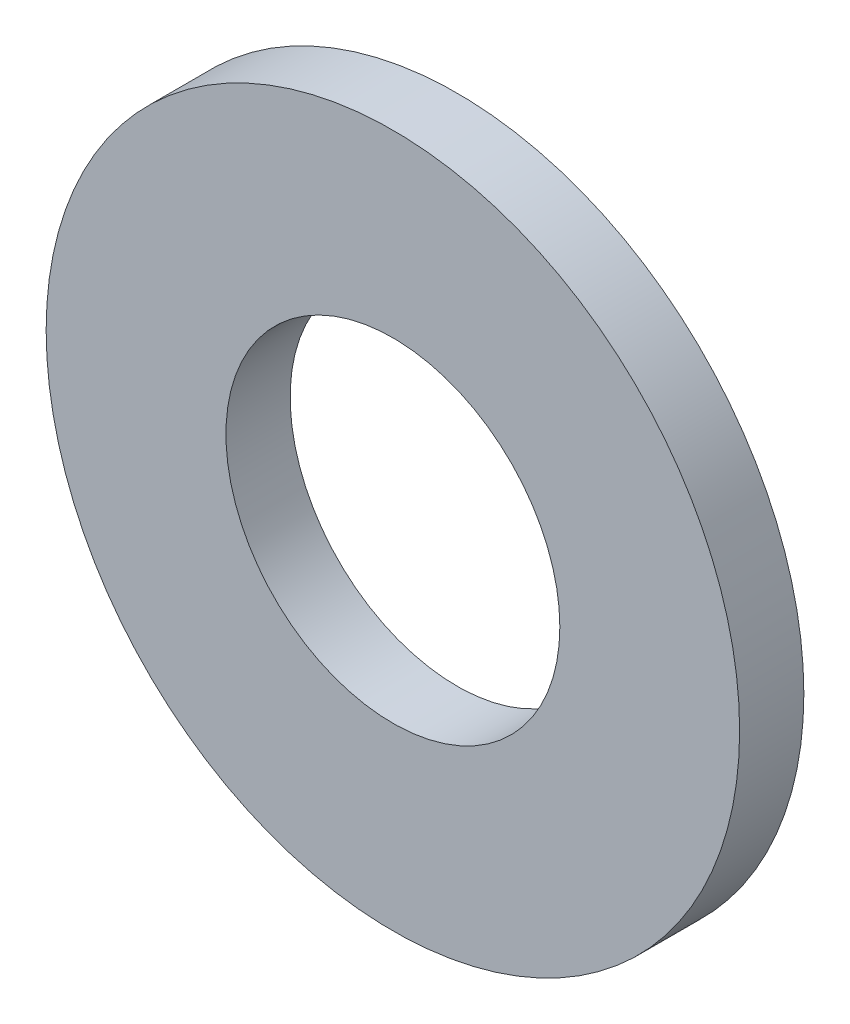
ISO-10303-21;
HEADER;
FILE_DESCRIPTION(('STEP AP214'),'2;1');
FILE_NAME('part.step','',(''),(''),'','','');
FILE_SCHEMA(('AUTOMOTIVE_DESIGN { 1 0 10303 214 1 1 1 1 }'));
ENDSEC;
DATA;
#1=APPLICATION_CONTEXT('core data for automotive mechanical design processes');
#2=APPLICATION_PROTOCOL_DEFINITION('international standard','automotive_design',2000,#1);
#3=PRODUCT_CONTEXT('',#1,'mechanical');
#4=PRODUCT('Part','Part','',(#3));
#5=PRODUCT_RELATED_PRODUCT_CATEGORY('part','',(#4));
#6=PRODUCT_DEFINITION_FORMATION('','',#4);
#7=PRODUCT_DEFINITION_CONTEXT('part definition',#1,'design');
#8=PRODUCT_DEFINITION('design','',#6,#7);
#9=PRODUCT_DEFINITION_SHAPE('','',#8);
#10=(LENGTH_UNIT() NAMED_UNIT(*) SI_UNIT(.MILLI.,.METRE.));
#11=(NAMED_UNIT(*) PLANE_ANGLE_UNIT() SI_UNIT($,.RADIAN.));
#12=(NAMED_UNIT(*) SI_UNIT($,.STERADIAN.) SOLID_ANGLE_UNIT());
#13=UNCERTAINTY_MEASURE_WITH_UNIT(LENGTH_MEASURE(1.E-05),#10,'distance_accuracy_value','');
#14=(GEOMETRIC_REPRESENTATION_CONTEXT(3) GLOBAL_UNCERTAINTY_ASSIGNED_CONTEXT((#13)) GLOBAL_UNIT_ASSIGNED_CONTEXT((#10,
#11,#12)) REPRESENTATION_CONTEXT('',''));
#15=CARTESIAN_POINT('',(0.,0.,0.));
#16=DIRECTION('',(0.,0.,1.));
#17=DIRECTION('',(1.,0.,0.));
#18=AXIS2_PLACEMENT_3D('',#15,#16,#17);
#19=CARTESIAN_POINT('',(67.,70.,2.5));
#20=DIRECTION('',(0.,0.,1.));
#21=DIRECTION('',(1.,0.,0.));
#22=AXIS2_PLACEMENT_3D('',#19,#20,#21);
#23=PLANE('',#22);
#24=CARTESIAN_POINT('',(67.,70.,2.5));
#25=DIRECTION('',(0.,0.,1.));
#26=DIRECTION('',(1.,0.,0.));
#27=AXIS2_PLACEMENT_3D('',#24,#25,#26);
#28=CIRCLE('',#27,13.5);
#29=CARTESIAN_POINT('',(80.5,70.,2.5));
#30=VERTEX_POINT('',#29);
#31=EDGE_CURVE('E10',#30,#30,#28,.T.);
#32=ORIENTED_EDGE('',*,*,#31,.T.);
#33=EDGE_LOOP('',(#32));
#34=FACE_BOUND('',#33,.T.);
#35=CARTESIAN_POINT('',(67.,70.,2.5));
#36=DIRECTION('',(0.,0.,1.));
#37=DIRECTION('',(1.,0.,0.));
#38=AXIS2_PLACEMENT_3D('',#35,#36,#37);
#39=CIRCLE('',#38,6.5);
#40=CARTESIAN_POINT('',(73.5,70.,2.5));
#41=VERTEX_POINT('',#40);
#42=EDGE_CURVE('E39',#41,#41,#39,.T.);
#43=ORIENTED_EDGE('',*,*,#42,.F.);
#44=EDGE_LOOP('',(#43));
#45=FACE_BOUND('',#44,.T.);
#46=ADVANCED_FACE('F28',(#34,#45),#23,.T.);
#47=CARTESIAN_POINT('',(67.,70.,0.));
#48=DIRECTION('',(0.,0.,1.));
#49=DIRECTION('',(1.,0.,0.));
#50=AXIS2_PLACEMENT_3D('',#47,#48,#49);
#51=PLANE('',#50);
#52=CARTESIAN_POINT('',(67.,70.,0.));
#53=DIRECTION('',(0.,0.,1.));
#54=DIRECTION('',(1.,0.,0.));
#55=AXIS2_PLACEMENT_3D('',#52,#53,#54);
#56=CIRCLE('',#55,13.5);
#57=CARTESIAN_POINT('',(80.5,70.,0.));
#58=VERTEX_POINT('',#57);
#59=EDGE_CURVE('E32',#58,#58,#56,.T.);
#60=ORIENTED_EDGE('',*,*,#59,.F.);
#61=EDGE_LOOP('',(#60));
#62=FACE_BOUND('',#61,.T.);
#63=CARTESIAN_POINT('',(67.,70.,0.));
#64=DIRECTION('',(0.,0.,1.));
#65=DIRECTION('',(1.,0.,0.));
#66=AXIS2_PLACEMENT_3D('',#63,#64,#65);
#67=CIRCLE('',#66,6.5);
#68=CARTESIAN_POINT('',(73.5,70.,0.));
#69=VERTEX_POINT('',#68);
#70=EDGE_CURVE('E41',#69,#69,#67,.T.);
#71=ORIENTED_EDGE('',*,*,#70,.T.);
#72=EDGE_LOOP('',(#71));
#73=FACE_BOUND('',#72,.T.);
#74=ADVANCED_FACE('F51',(#62,#73),#51,.F.);
#75=CARTESIAN_POINT('',(67.,70.,2.5));
#76=DIRECTION('',(0.,0.,-1.));
#77=DIRECTION('',(-1.,0.,0.));
#78=AXIS2_PLACEMENT_3D('',#75,#76,#77);
#79=CYLINDRICAL_SURFACE('',#78,13.5);
#80=ORIENTED_EDGE('',*,*,#31,.F.);
#81=EDGE_LOOP('',(#80));
#82=FACE_BOUND('',#81,.T.);
#83=ORIENTED_EDGE('',*,*,#59,.T.);
#84=EDGE_LOOP('',(#83));
#85=FACE_BOUND('',#84,.T.);
#86=ADVANCED_FACE('F30',(#82,#85),#79,.T.);
#87=CARTESIAN_POINT('',(67.,70.,2.5));
#88=DIRECTION('',(0.,0.,-1.));
#89=DIRECTION('',(-1.,0.,0.));
#90=AXIS2_PLACEMENT_3D('',#87,#88,#89);
#91=CYLINDRICAL_SURFACE('',#90,6.5);
#92=ORIENTED_EDGE('',*,*,#42,.T.);
#93=EDGE_LOOP('',(#92));
#94=FACE_BOUND('',#93,.T.);
#95=ORIENTED_EDGE('',*,*,#70,.F.);
#96=EDGE_LOOP('',(#95));
#97=FACE_BOUND('',#96,.T.);
#98=ADVANCED_FACE('F47',(#94,#97),#91,.F.);
#99=CLOSED_SHELL('',(#46,#74,#86,#98));
#100=MANIFOLD_SOLID_BREP('B2',#99);
#101=ADVANCED_BREP_SHAPE_REPRESENTATION('',(#18,#100),#14);
#102=SHAPE_DEFINITION_REPRESENTATION(#9,#101);
ENDSEC;
END-ISO-10303-21;
